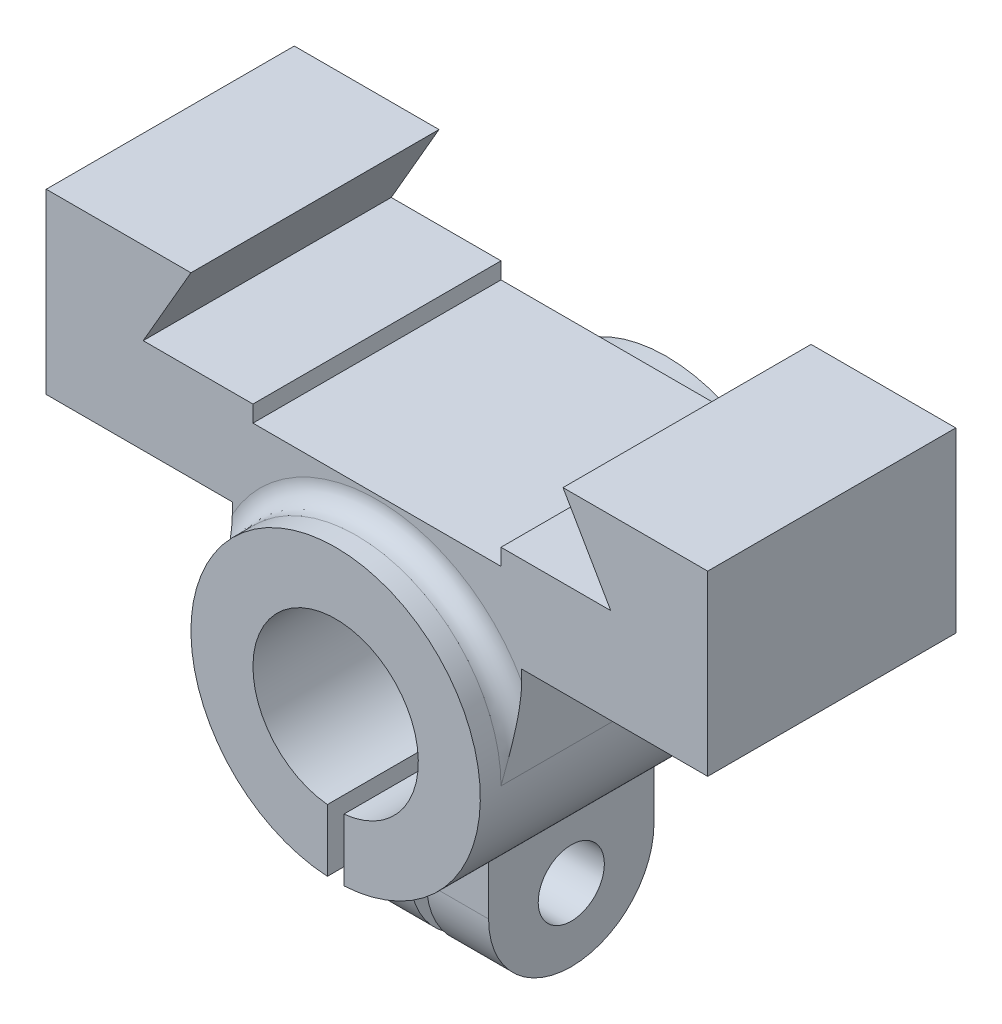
ISO-10303-21;
HEADER;
FILE_DESCRIPTION(('STEP AP214'),'2;1');
FILE_NAME('part.step','',(''),(''),'','','');
FILE_SCHEMA(('AUTOMOTIVE_DESIGN { 1 0 10303 214 1 1 1 1 }'));
ENDSEC;
DATA;
#1=APPLICATION_CONTEXT('core data for automotive mechanical design processes');
#2=APPLICATION_PROTOCOL_DEFINITION('international standard','automotive_design',2000,#1);
#3=PRODUCT_CONTEXT('',#1,'mechanical');
#4=PRODUCT('Part','Part','',(#3));
#5=PRODUCT_RELATED_PRODUCT_CATEGORY('part','',(#4));
#6=PRODUCT_DEFINITION_FORMATION('','',#4);
#7=PRODUCT_DEFINITION_CONTEXT('part definition',#1,'design');
#8=PRODUCT_DEFINITION('design','',#6,#7);
#9=PRODUCT_DEFINITION_SHAPE('','',#8);
#10=(LENGTH_UNIT() NAMED_UNIT(*) SI_UNIT(.MILLI.,.METRE.));
#11=(NAMED_UNIT(*) PLANE_ANGLE_UNIT() SI_UNIT($,.RADIAN.));
#12=(NAMED_UNIT(*) SI_UNIT($,.STERADIAN.) SOLID_ANGLE_UNIT());
#13=UNCERTAINTY_MEASURE_WITH_UNIT(LENGTH_MEASURE(1.E-05),#10,'distance_accuracy_value','');
#14=(GEOMETRIC_REPRESENTATION_CONTEXT(3) GLOBAL_UNCERTAINTY_ASSIGNED_CONTEXT((#13)) GLOBAL_UNIT_ASSIGNED_CONTEXT((#10,
#11,#12)) REPRESENTATION_CONTEXT('',''));
#15=CARTESIAN_POINT('',(0.,0.,0.));
#16=DIRECTION('',(0.,0.,1.));
#17=DIRECTION('',(1.,0.,0.));
#18=AXIS2_PLACEMENT_3D('',#15,#16,#17);
#19=CARTESIAN_POINT('',(-119.306058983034,-1.16931228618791,-40.));
#20=DIRECTION('',(0.,0.,1.));
#21=DIRECTION('',(1.,0.,0.));
#22=AXIS2_PLACEMENT_3D('',#19,#20,#21);
#23=CYLINDRICAL_SURFACE('',#22,35.);
#24=DIRECTION('',(0.,0.,1.));
#25=VECTOR('',#24,1.);
#26=CARTESIAN_POINT('',(-121.306058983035,-36.1121227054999,-40.));
#27=LINE('',#26,#25);
#28=CARTESIAN_POINT('',(-121.306058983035,-36.1121227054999,20.));
#29=VERTEX_POINT('',#28);
#30=CARTESIAN_POINT('',(-121.306058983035,-36.1121227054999,40.));
#31=VERTEX_POINT('',#30);
#32=EDGE_CURVE('E348',#29,#31,#27,.T.);
#33=ORIENTED_EDGE('',*,*,#32,.T.);
#34=CARTESIAN_POINT('',(-119.306058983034,-1.16931228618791,40.));
#35=DIRECTION('',(0.,0.,1.));
#36=DIRECTION('',(1.,0.,0.));
#37=AXIS2_PLACEMENT_3D('',#34,#35,#36);
#38=CIRCLE('',#37,35.);
#39=CARTESIAN_POINT('',(-117.306058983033,-36.1121227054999,40.));
#40=VERTEX_POINT('',#39);
#41=EDGE_CURVE('E468',#31,#40,#38,.F.);
#42=ORIENTED_EDGE('',*,*,#41,.T.);
#43=DIRECTION('',(0.,0.,1.));
#44=VECTOR('',#43,1.);
#45=CARTESIAN_POINT('',(-117.306058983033,-36.1121227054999,-40.));
#46=LINE('',#45,#44);
#47=CARTESIAN_POINT('',(-117.306058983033,-36.1121227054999,20.));
#48=VERTEX_POINT('',#47);
#49=EDGE_CURVE('E503',#48,#40,#46,.T.);
#50=ORIENTED_EDGE('',*,*,#49,.F.);
#51=CARTESIAN_POINT('',(-119.306058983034,-1.16931228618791,20.));
#52=DIRECTION('',(0.,0.,1.));
#53=DIRECTION('',(1.,0.,0.));
#54=AXIS2_PLACEMENT_3D('',#51,#52,#53);
#55=CIRCLE('',#54,35.);
#56=CARTESIAN_POINT('',(-102.306058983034,-31.7634293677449,20.));
#57=VERTEX_POINT('',#56);
#58=EDGE_CURVE('E696',#57,#48,#55,.F.);
#59=ORIENTED_EDGE('',*,*,#58,.F.);
#60=DIRECTION('',(0.,0.,1.));
#61=VECTOR('',#60,1.);
#62=CARTESIAN_POINT('',(-102.306058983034,-31.7634293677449,-20.));
#63=LINE('',#62,#61);
#64=CARTESIAN_POINT('',(-102.306058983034,-31.7634293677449,-20.));
#65=VERTEX_POINT('',#64);
#66=EDGE_CURVE('E543',#65,#57,#63,.T.);
#67=ORIENTED_EDGE('',*,*,#66,.F.);
#68=CARTESIAN_POINT('',(-119.306058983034,-1.16931228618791,-20.));
#69=DIRECTION('',(0.,0.,1.));
#70=DIRECTION('',(1.,0.,0.));
#71=AXIS2_PLACEMENT_3D('',#68,#69,#70);
#72=CIRCLE('',#71,35.);
#73=CARTESIAN_POINT('',(-117.306058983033,-36.1121227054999,-20.));
#74=VERTEX_POINT('',#73);
#75=EDGE_CURVE('E703',#65,#74,#72,.F.);
#76=ORIENTED_EDGE('',*,*,#75,.T.);
#77=CARTESIAN_POINT('',(-117.306058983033,-36.1121227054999,-40.));
#78=VERTEX_POINT('',#77);
#79=EDGE_CURVE('E499',#78,#74,#46,.T.);
#80=ORIENTED_EDGE('',*,*,#79,.F.);
#81=CARTESIAN_POINT('',(-119.306058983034,-1.16931228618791,-40.));
#82=DIRECTION('',(0.,0.,1.));
#83=DIRECTION('',(1.,0.,0.));
#84=AXIS2_PLACEMENT_3D('',#81,#82,#83);
#85=CIRCLE('',#84,35.);
#86=CARTESIAN_POINT('',(-121.306058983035,-36.1121227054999,-40.));
#87=VERTEX_POINT('',#86);
#88=EDGE_CURVE('E497',#87,#78,#85,.F.);
#89=ORIENTED_EDGE('',*,*,#88,.F.);
#90=CARTESIAN_POINT('',(-121.306058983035,-36.1121227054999,-20.));
#91=VERTEX_POINT('',#90);
#92=EDGE_CURVE('E345',#87,#91,#27,.T.);
#93=ORIENTED_EDGE('',*,*,#92,.T.);
#94=CARTESIAN_POINT('',(-119.306058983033,-1.16931228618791,-20.));
#95=DIRECTION('',(0.,0.,-1.));
#96=DIRECTION('',(-1.,0.,0.));
#97=AXIS2_PLACEMENT_3D('',#94,#95,#96);
#98=CIRCLE('',#97,35.);
#99=CARTESIAN_POINT('',(-136.306058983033,-31.7634293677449,-20.));
#100=VERTEX_POINT('',#99);
#101=EDGE_CURVE('E278',#100,#91,#98,.F.);
#102=ORIENTED_EDGE('',*,*,#101,.F.);
#103=DIRECTION('',(0.,0.,1.));
#104=VECTOR('',#103,1.);
#105=CARTESIAN_POINT('',(-136.306058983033,-31.7634293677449,-20.));
#106=LINE('',#105,#104);
#107=CARTESIAN_POINT('',(-136.306058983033,-31.7634293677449,20.));
#108=VERTEX_POINT('',#107);
#109=EDGE_CURVE('E258',#100,#108,#106,.T.);
#110=ORIENTED_EDGE('',*,*,#109,.T.);
#111=CARTESIAN_POINT('',(-119.306058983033,-1.16931228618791,20.));
#112=DIRECTION('',(0.,0.,-1.));
#113=DIRECTION('',(-1.,0.,0.));
#114=AXIS2_PLACEMENT_3D('',#111,#112,#113);
#115=CIRCLE('',#114,35.);
#116=EDGE_CURVE('E264',#108,#29,#115,.F.);
#117=ORIENTED_EDGE('',*,*,#116,.T.);
#118=EDGE_LOOP('',(#33,#42,#50,#59,#67,#76,#80,#89,#93,#102,#110,#117));
#119=FACE_BOUND('',#118,.T.);
#120=CARTESIAN_POINT('',(-119.306058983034,-1.16931228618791,35.));
#121=DIRECTION('',(0.,0.,1.));
#122=DIRECTION('',(1.,0.,0.));
#123=AXIS2_PLACEMENT_3D('',#120,#121,#122);
#124=CIRCLE('',#123,35.);
#125=CARTESIAN_POINT('',(-84.3060589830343,-1.16931228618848,35.));
#126=VERTEX_POINT('',#125);
#127=CARTESIAN_POINT('',(-154.306058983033,-1.16931228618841,35.));
#128=VERTEX_POINT('',#127);
#129=EDGE_CURVE('E517',#126,#128,#124,.T.);
#130=ORIENTED_EDGE('',*,*,#129,.T.);
#131=DIRECTION('',(0.,0.,1.));
#132=VECTOR('',#131,1.);
#133=CARTESIAN_POINT('',(-154.306058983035,-1.16931228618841,-30.));
#134=LINE('',#133,#132);
#135=CARTESIAN_POINT('',(-154.306058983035,-1.16931228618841,-35.));
#136=VERTEX_POINT('',#135);
#137=EDGE_CURVE('E314',#136,#128,#134,.T.);
#138=ORIENTED_EDGE('',*,*,#137,.F.);
#139=CARTESIAN_POINT('',(-119.306058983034,-1.16931228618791,-35.));
#140=DIRECTION('',(0.,0.,1.));
#141=DIRECTION('',(1.,0.,0.));
#142=AXIS2_PLACEMENT_3D('',#139,#140,#141);
#143=CIRCLE('',#142,35.);
#144=CARTESIAN_POINT('',(-84.3060589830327,-1.16931228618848,-35.));
#145=VERTEX_POINT('',#144);
#146=EDGE_CURVE('E524',#136,#145,#143,.F.);
#147=ORIENTED_EDGE('',*,*,#146,.T.);
#148=DIRECTION('',(0.,0.,1.));
#149=VECTOR('',#148,1.);
#150=CARTESIAN_POINT('',(-84.3060589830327,-1.16931228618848,-30.));
#151=LINE('',#150,#149);
#152=EDGE_CURVE('E491',#145,#126,#151,.T.);
#153=ORIENTED_EDGE('',*,*,#152,.T.);
#154=EDGE_LOOP('',(#130,#138,#147,#153));
#155=FACE_BOUND('',#154,.T.);
#156=ADVANCED_FACE('F39',(#119,#155),#23,.T.);
#157=CARTESIAN_POINT('',(-117.306058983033,0.,-40.));
#158=DIRECTION('',(1.,0.,0.));
#159=DIRECTION('',(0.,0.,-1.));
#160=AXIS2_PLACEMENT_3D('',#157,#158,#159);
#161=PLANE('',#160);
#162=CARTESIAN_POINT('',(-117.306058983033,-48.0000000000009,0.));
#163=DIRECTION('',(1.,0.,0.));
#164=DIRECTION('',(0.,0.,-1.));
#165=AXIS2_PLACEMENT_3D('',#162,#163,#164);
#166=CIRCLE('',#165,8.);
#167=CARTESIAN_POINT('',(-117.306058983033,-48.0000000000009,-8.00000000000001));
#168=VERTEX_POINT('',#167);
#169=EDGE_CURVE('E522',#168,#168,#166,.T.);
#170=ORIENTED_EDGE('',*,*,#169,.T.);
#171=EDGE_LOOP('',(#170));
#172=FACE_BOUND('',#171,.T.);
#173=CARTESIAN_POINT('',(-117.306058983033,-45.5465356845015,0.));
#174=DIRECTION('',(1.,0.,0.));
#175=DIRECTION('',(0.,0.,-1.));
#176=AXIS2_PLACEMENT_3D('',#173,#174,#175);
#177=CIRCLE('',#176,20.);
#178=CARTESIAN_POINT('',(-117.306058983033,-45.5465356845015,-20.));
#179=VERTEX_POINT('',#178);
#180=CARTESIAN_POINT('',(-117.306058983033,-65.5465356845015,0.));
#181=VERTEX_POINT('',#180);
#182=EDGE_CURVE('E511',#179,#181,#177,.F.);
#183=ORIENTED_EDGE('',*,*,#182,.T.);
#184=CARTESIAN_POINT('',(-117.306058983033,-45.5465356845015,0.));
#185=DIRECTION('',(1.,0.,0.));
#186=DIRECTION('',(0.,0.,-1.));
#187=AXIS2_PLACEMENT_3D('',#184,#185,#186);
#188=CIRCLE('',#187,20.);
#189=CARTESIAN_POINT('',(-117.306058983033,-45.5465356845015,20.));
#190=VERTEX_POINT('',#189);
#191=EDGE_CURVE('E513',#181,#190,#188,.F.);
#192=ORIENTED_EDGE('',*,*,#191,.T.);
#193=DIRECTION('',(0.,1.,0.));
#194=VECTOR('',#193,1.);
#195=CARTESIAN_POINT('',(-117.306058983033,0.,20.));
#196=LINE('',#195,#194);
#197=EDGE_CURVE('E699',#190,#48,#196,.T.);
#198=ORIENTED_EDGE('',*,*,#197,.T.);
#199=ORIENTED_EDGE('',*,*,#49,.T.);
#200=DIRECTION('',(0.,1.,0.));
#201=VECTOR('',#200,1.);
#202=CARTESIAN_POINT('',(-117.306058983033,0.,40.));
#203=LINE('',#202,#201);
#204=CARTESIAN_POINT('',(-117.306058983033,-21.0690610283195,40.));
#205=VERTEX_POINT('',#204);
#206=EDGE_CURVE('E472',#40,#205,#203,.T.);
#207=ORIENTED_EDGE('',*,*,#206,.T.);
#208=DIRECTION('',(0.,0.,1.));
#209=VECTOR('',#208,1.);
#210=CARTESIAN_POINT('',(-117.306058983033,-21.0690610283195,-40.));
#211=LINE('',#210,#209);
#212=CARTESIAN_POINT('',(-117.306058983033,-21.0690610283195,-40.));
#213=VERTEX_POINT('',#212);
#214=EDGE_CURVE('E484',#213,#205,#211,.T.);
#215=ORIENTED_EDGE('',*,*,#214,.F.);
#216=DIRECTION('',(0.,1.,0.));
#217=VECTOR('',#216,1.);
#218=CARTESIAN_POINT('',(-117.306058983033,0.,-40.));
#219=LINE('',#218,#217);
#220=EDGE_CURVE('E495',#78,#213,#219,.T.);
#221=ORIENTED_EDGE('',*,*,#220,.F.);
#222=ORIENTED_EDGE('',*,*,#79,.T.);
#223=DIRECTION('',(0.,1.,0.));
#224=VECTOR('',#223,1.);
#225=CARTESIAN_POINT('',(-117.306058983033,0.,-20.));
#226=LINE('',#225,#224);
#227=EDGE_CURVE('E548',#179,#74,#226,.T.);
#228=ORIENTED_EDGE('',*,*,#227,.F.);
#229=EDGE_LOOP('',(#183,#192,#198,#199,#207,#215,#221,#222,#228));
#230=FACE_BOUND('',#229,.T.);
#231=ADVANCED_FACE('F411',(#172,#230),#161,.F.);
#232=CARTESIAN_POINT('',(-119.306058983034,-1.16931228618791,-40.));
#233=DIRECTION('',(0.,0.,1.));
#234=DIRECTION('',(1.,0.,0.));
#235=AXIS2_PLACEMENT_3D('',#232,#233,#234);
#236=CYLINDRICAL_SURFACE('',#235,20.);
#237=ORIENTED_EDGE('',*,*,#214,.T.);
#238=CARTESIAN_POINT('',(-119.306058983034,-1.16931228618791,40.));
#239=DIRECTION('',(0.,0.,1.));
#240=DIRECTION('',(1.,0.,0.));
#241=AXIS2_PLACEMENT_3D('',#238,#239,#240);
#242=CIRCLE('',#241,20.);
#243=CARTESIAN_POINT('',(-121.306058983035,-21.0690610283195,40.));
#244=VERTEX_POINT('',#243);
#245=EDGE_CURVE('E482',#244,#205,#242,.F.);
#246=ORIENTED_EDGE('',*,*,#245,.F.);
#247=DIRECTION('',(0.,0.,1.));
#248=VECTOR('',#247,1.);
#249=CARTESIAN_POINT('',(-121.306058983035,-21.0690610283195,-40.));
#250=LINE('',#249,#248);
#251=CARTESIAN_POINT('',(-121.306058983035,-21.0690610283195,-40.));
#252=VERTEX_POINT('',#251);
#253=EDGE_CURVE('E344',#252,#244,#250,.T.);
#254=ORIENTED_EDGE('',*,*,#253,.F.);
#255=CARTESIAN_POINT('',(-119.306058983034,-1.16931228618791,-40.));
#256=DIRECTION('',(0.,0.,1.));
#257=DIRECTION('',(1.,0.,0.));
#258=AXIS2_PLACEMENT_3D('',#255,#256,#257);
#259=CIRCLE('',#258,20.);
#260=EDGE_CURVE('E474',#252,#213,#259,.F.);
#261=ORIENTED_EDGE('',*,*,#260,.T.);
#262=EDGE_LOOP('',(#237,#246,#254,#261));
#263=FACE_BOUND('',#262,.T.);
#264=ADVANCED_FACE('F416',(#263),#236,.F.);
#265=CARTESIAN_POINT('',(0.,0.,-40.));
#266=DIRECTION('',(0.,0.,1.));
#267=DIRECTION('',(1.,0.,0.));
#268=AXIS2_PLACEMENT_3D('',#265,#266,#267);
#269=PLANE('',#268);
#270=ORIENTED_EDGE('',*,*,#260,.F.);
#271=DIRECTION('',(0.,1.,0.));
#272=VECTOR('',#271,1.);
#273=CARTESIAN_POINT('',(-121.306058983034,0.,-40.));
#274=LINE('',#273,#272);
#275=EDGE_CURVE('E341',#87,#252,#274,.T.);
#276=ORIENTED_EDGE('',*,*,#275,.F.);
#277=ORIENTED_EDGE('',*,*,#88,.T.);
#278=ORIENTED_EDGE('',*,*,#220,.T.);
#279=EDGE_LOOP('',(#270,#276,#277,#278));
#280=FACE_BOUND('',#279,.T.);
#281=ADVANCED_FACE('F420',(#280),#269,.F.);
#282=CARTESIAN_POINT('',(0.,0.,40.));
#283=DIRECTION('',(0.,0.,1.));
#284=DIRECTION('',(1.,0.,0.));
#285=AXIS2_PLACEMENT_3D('',#282,#283,#284);
#286=PLANE('',#285);
#287=ORIENTED_EDGE('',*,*,#41,.F.);
#288=DIRECTION('',(0.,1.,0.));
#289=VECTOR('',#288,1.);
#290=CARTESIAN_POINT('',(-121.306058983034,0.,40.));
#291=LINE('',#290,#289);
#292=EDGE_CURVE('E318',#31,#244,#291,.T.);
#293=ORIENTED_EDGE('',*,*,#292,.T.);
#294=ORIENTED_EDGE('',*,*,#245,.T.);
#295=ORIENTED_EDGE('',*,*,#206,.F.);
#296=EDGE_LOOP('',(#287,#293,#294,#295));
#297=FACE_BOUND('',#296,.T.);
#298=ADVANCED_FACE('F453',(#297),#286,.T.);
#299=CARTESIAN_POINT('',(-6.17250712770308E-13,39.8306877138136,-30.));
#300=DIRECTION('',(0.,1.,0.));
#301=DIRECTION('',(-1.,0.,0.));
#302=AXIS2_PLACEMENT_3D('',#299,#300,#301);
#303=PLANE('',#302);
#304=DIRECTION('',(-1.,0.,0.));
#305=VECTOR('',#304,1.);
#306=CARTESIAN_POINT('',(-6.17250712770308E-13,39.8306877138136,-30.));
#307=LINE('',#306,#305);
#308=CARTESIAN_POINT('',(-89.306058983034,39.8306877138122,-30.));
#309=VERTEX_POINT('',#308);
#310=CARTESIAN_POINT('',(-149.306058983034,39.8306877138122,-30.));
#311=VERTEX_POINT('',#310);
#312=EDGE_CURVE('E588',#309,#311,#307,.T.);
#313=ORIENTED_EDGE('',*,*,#312,.T.);
#314=DIRECTION('',(0.,0.,1.));
#315=VECTOR('',#314,1.);
#316=CARTESIAN_POINT('',(-149.306058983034,39.8306877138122,-30.));
#317=LINE('',#316,#315);
#318=CARTESIAN_POINT('',(-149.306058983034,39.8306877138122,30.));
#319=VERTEX_POINT('',#318);
#320=EDGE_CURVE('E315',#311,#319,#317,.T.);
#321=ORIENTED_EDGE('',*,*,#320,.T.);
#322=DIRECTION('',(-1.,0.,0.));
#323=VECTOR('',#322,1.);
#324=CARTESIAN_POINT('',(-6.17250712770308E-13,39.8306877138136,30.));
#325=LINE('',#324,#323);
#326=CARTESIAN_POINT('',(-89.306058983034,39.8306877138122,30.));
#327=VERTEX_POINT('',#326);
#328=EDGE_CURVE('E566',#327,#319,#325,.T.);
#329=ORIENTED_EDGE('',*,*,#328,.F.);
#330=DIRECTION('',(0.,0.,1.));
#331=VECTOR('',#330,1.);
#332=CARTESIAN_POINT('',(-89.306058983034,39.8306877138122,-30.));
#333=LINE('',#332,#331);
#334=EDGE_CURVE('E485',#309,#327,#333,.T.);
#335=ORIENTED_EDGE('',*,*,#334,.F.);
#336=EDGE_LOOP('',(#313,#321,#329,#335));
#337=FACE_BOUND('',#336,.T.);
#338=ADVANCED_FACE('F456',(#337),#303,.T.);
#339=CARTESIAN_POINT('',(-89.3060589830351,2.47874107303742E-12,-30.));
#340=DIRECTION('',(-1.,0.,0.));
#341=DIRECTION('',(0.,-1.,0.));
#342=AXIS2_PLACEMENT_3D('',#339,#340,#341);
#343=PLANE('',#342);
#344=ORIENTED_EDGE('',*,*,#334,.T.);
#345=DIRECTION('',(0.,-1.,0.));
#346=VECTOR('',#345,1.);
#347=CARTESIAN_POINT('',(-89.3060589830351,2.47874107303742E-12,30.));
#348=LINE('',#347,#346);
#349=CARTESIAN_POINT('',(-89.3060589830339,43.8306877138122,30.));
#350=VERTEX_POINT('',#349);
#351=EDGE_CURVE('E563',#350,#327,#348,.T.);
#352=ORIENTED_EDGE('',*,*,#351,.F.);
#353=DIRECTION('',(0.,0.,1.));
#354=VECTOR('',#353,1.);
#355=CARTESIAN_POINT('',(-89.3060589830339,43.8306877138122,-30.));
#356=LINE('',#355,#354);
#357=CARTESIAN_POINT('',(-89.3060589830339,43.8306877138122,-30.));
#358=VERTEX_POINT('',#357);
#359=EDGE_CURVE('E488',#358,#350,#356,.T.);
#360=ORIENTED_EDGE('',*,*,#359,.F.);
#361=DIRECTION('',(0.,-1.,0.));
#362=VECTOR('',#361,1.);
#363=CARTESIAN_POINT('',(-89.3060589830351,2.47874107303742E-12,-30.));
#364=LINE('',#363,#362);
#365=EDGE_CURVE('E585',#358,#309,#364,.T.);
#366=ORIENTED_EDGE('',*,*,#365,.T.);
#367=EDGE_LOOP('',(#344,#352,#360,#366));
#368=FACE_BOUND('',#367,.T.);
#369=ADVANCED_FACE('F462',(#368),#343,.T.);
#370=CARTESIAN_POINT('',(1.28313105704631E-12,43.8306877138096,-30.));
#371=DIRECTION('',(0.,1.,0.));
#372=DIRECTION('',(-1.,0.,0.));
#373=AXIS2_PLACEMENT_3D('',#370,#371,#372);
#374=PLANE('',#373);
#375=ORIENTED_EDGE('',*,*,#359,.T.);
#376=DIRECTION('',(-1.,0.,0.));
#377=VECTOR('',#376,1.);
#378=CARTESIAN_POINT('',(1.28313105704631E-12,43.8306877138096,30.));
#379=LINE('',#378,#377);
#380=CARTESIAN_POINT('',(-62.7590535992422,43.8306877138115,30.));
#381=VERTEX_POINT('',#380);
#382=EDGE_CURVE('E560',#381,#350,#379,.T.);
#383=ORIENTED_EDGE('',*,*,#382,.F.);
#384=DIRECTION('',(0.,0.,1.));
#385=VECTOR('',#384,1.);
#386=CARTESIAN_POINT('',(-62.7590535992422,43.8306877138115,-30.));
#387=LINE('',#386,#385);
#388=CARTESIAN_POINT('',(-62.7590535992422,43.8306877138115,-30.));
#389=VERTEX_POINT('',#388);
#390=EDGE_CURVE('E591',#389,#381,#387,.T.);
#391=ORIENTED_EDGE('',*,*,#390,.F.);
#392=DIRECTION('',(-1.,0.,0.));
#393=VECTOR('',#392,1.);
#394=CARTESIAN_POINT('',(1.28313105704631E-12,43.8306877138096,-30.));
#395=LINE('',#394,#393);
#396=EDGE_CURVE('E582',#389,#358,#395,.T.);
#397=ORIENTED_EDGE('',*,*,#396,.T.);
#398=EDGE_LOOP('',(#375,#383,#391,#397));
#399=FACE_BOUND('',#398,.T.);
#400=ADVANCED_FACE('F637',(#399),#374,.T.);
#401=CARTESIAN_POINT('',(-28.0900456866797,-16.2177954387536,-30.));
#402=DIRECTION('',(-0.866025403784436,-0.500000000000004,0.));
#403=DIRECTION('',(0.500000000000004,-0.866025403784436,0.));
#404=AXIS2_PLACEMENT_3D('',#401,#402,#403);
#405=PLANE('',#404);
#406=ORIENTED_EDGE('',*,*,#390,.T.);
#407=DIRECTION('',(0.500000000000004,-0.866025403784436,0.));
#408=VECTOR('',#407,1.);
#409=CARTESIAN_POINT('',(-28.0900456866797,-16.2177954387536,30.));
#410=LINE('',#409,#408);
#411=CARTESIAN_POINT('',(-74.3060589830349,63.8306877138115,30.));
#412=VERTEX_POINT('',#411);
#413=EDGE_CURVE('E557',#412,#381,#410,.T.);
#414=ORIENTED_EDGE('',*,*,#413,.F.);
#415=DIRECTION('',(0.,0.,1.));
#416=VECTOR('',#415,1.);
#417=CARTESIAN_POINT('',(-74.3060589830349,63.8306877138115,-30.));
#418=LINE('',#417,#416);
#419=CARTESIAN_POINT('',(-74.3060589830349,63.8306877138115,-30.));
#420=VERTEX_POINT('',#419);
#421=EDGE_CURVE('E593',#420,#412,#418,.T.);
#422=ORIENTED_EDGE('',*,*,#421,.F.);
#423=DIRECTION('',(0.500000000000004,-0.866025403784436,0.));
#424=VECTOR('',#423,1.);
#425=CARTESIAN_POINT('',(-28.0900456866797,-16.2177954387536,-30.));
#426=LINE('',#425,#424);
#427=EDGE_CURVE('E579',#420,#389,#426,.T.);
#428=ORIENTED_EDGE('',*,*,#427,.T.);
#429=EDGE_LOOP('',(#406,#414,#422,#428));
#430=FACE_BOUND('',#429,.T.);
#431=ADVANCED_FACE('F641',(#430),#405,.T.);
#432=CARTESIAN_POINT('',(-1.13892266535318E-12,63.8306877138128,-30.));
#433=DIRECTION('',(0.,1.,0.));
#434=DIRECTION('',(-1.,0.,0.));
#435=AXIS2_PLACEMENT_3D('',#432,#433,#434);
#436=PLANE('',#435);
#437=ORIENTED_EDGE('',*,*,#421,.T.);
#438=DIRECTION('',(-1.,0.,0.));
#439=VECTOR('',#438,1.);
#440=CARTESIAN_POINT('',(-1.13892266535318E-12,63.8306877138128,30.));
#441=LINE('',#440,#439);
#442=CARTESIAN_POINT('',(-39.3060589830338,63.8306877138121,30.));
#443=VERTEX_POINT('',#442);
#444=EDGE_CURVE('E554',#443,#412,#441,.T.);
#445=ORIENTED_EDGE('',*,*,#444,.F.);
#446=DIRECTION('',(0.,0.,1.));
#447=VECTOR('',#446,1.);
#448=CARTESIAN_POINT('',(-39.3060589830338,63.8306877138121,-30.));
#449=LINE('',#448,#447);
#450=CARTESIAN_POINT('',(-39.3060589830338,63.8306877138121,-30.));
#451=VERTEX_POINT('',#450);
#452=EDGE_CURVE('E595',#451,#443,#449,.T.);
#453=ORIENTED_EDGE('',*,*,#452,.F.);
#454=DIRECTION('',(-1.,0.,0.));
#455=VECTOR('',#454,1.);
#456=CARTESIAN_POINT('',(-1.13892266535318E-12,63.8306877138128,-30.));
#457=LINE('',#456,#455);
#458=EDGE_CURVE('E576',#451,#420,#457,.T.);
#459=ORIENTED_EDGE('',*,*,#458,.T.);
#460=EDGE_LOOP('',(#437,#445,#453,#459));
#461=FACE_BOUND('',#460,.T.);
#462=ADVANCED_FACE('F646',(#461),#436,.T.);
#463=CARTESIAN_POINT('',(-39.3060589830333,-3.5519702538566E-13,-30.));
#464=DIRECTION('',(1.,0.,0.));
#465=DIRECTION('',(0.,1.,0.));
#466=AXIS2_PLACEMENT_3D('',#463,#464,#465);
#467=PLANE('',#466);
#468=ORIENTED_EDGE('',*,*,#452,.T.);
#469=DIRECTION('',(0.,1.,0.));
#470=VECTOR('',#469,1.);
#471=CARTESIAN_POINT('',(-39.3060589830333,-3.5519702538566E-13,30.));
#472=LINE('',#471,#470);
#473=CARTESIAN_POINT('',(-39.3060589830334,20.8306877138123,30.));
#474=VERTEX_POINT('',#473);
#475=EDGE_CURVE('E545',#474,#443,#472,.T.);
#476=ORIENTED_EDGE('',*,*,#475,.F.);
#477=DIRECTION('',(0.,0.,1.));
#478=VECTOR('',#477,1.);
#479=CARTESIAN_POINT('',(-39.3060589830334,20.8306877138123,-30.));
#480=LINE('',#479,#478);
#481=CARTESIAN_POINT('',(-39.3060589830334,20.8306877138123,-30.));
#482=VERTEX_POINT('',#481);
#483=EDGE_CURVE('E597',#482,#474,#480,.T.);
#484=ORIENTED_EDGE('',*,*,#483,.F.);
#485=DIRECTION('',(0.,1.,0.));
#486=VECTOR('',#485,1.);
#487=CARTESIAN_POINT('',(-39.3060589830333,-3.5519702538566E-13,-30.));
#488=LINE('',#487,#486);
#489=EDGE_CURVE('E573',#482,#451,#488,.T.);
#490=ORIENTED_EDGE('',*,*,#489,.T.);
#491=EDGE_LOOP('',(#468,#476,#484,#490));
#492=FACE_BOUND('',#491,.T.);
#493=ADVANCED_FACE('F649',(#492),#467,.T.);
#494=CARTESIAN_POINT('',(-3.53324722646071E-13,20.830687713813,-30.));
#495=DIRECTION('',(0.,-1.,0.));
#496=DIRECTION('',(1.,0.,0.));
#497=AXIS2_PLACEMENT_3D('',#494,#495,#496);
#498=PLANE('',#497);
#499=ORIENTED_EDGE('',*,*,#483,.T.);
#500=DIRECTION('',(1.,0.,0.));
#501=VECTOR('',#500,1.);
#502=CARTESIAN_POINT('',(-3.53324722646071E-13,20.830687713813,30.));
#503=LINE('',#502,#501);
#504=CARTESIAN_POINT('',(-84.3060589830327,20.8306877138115,30.));
#505=VERTEX_POINT('',#504);
#506=EDGE_CURVE('E542',#505,#474,#503,.T.);
#507=ORIENTED_EDGE('',*,*,#506,.F.);
#508=DIRECTION('',(0.,0.,1.));
#509=VECTOR('',#508,1.);
#510=CARTESIAN_POINT('',(-84.3060589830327,20.8306877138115,-30.));
#511=LINE('',#510,#509);
#512=CARTESIAN_POINT('',(-84.3060589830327,20.8306877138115,-30.));
#513=VERTEX_POINT('',#512);
#514=EDGE_CURVE('E540',#513,#505,#511,.T.);
#515=ORIENTED_EDGE('',*,*,#514,.F.);
#516=DIRECTION('',(1.,0.,0.));
#517=VECTOR('',#516,1.);
#518=CARTESIAN_POINT('',(-3.53324722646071E-13,20.830687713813,-30.));
#519=LINE('',#518,#517);
#520=EDGE_CURVE('E570',#513,#482,#519,.T.);
#521=ORIENTED_EDGE('',*,*,#520,.T.);
#522=EDGE_LOOP('',(#499,#507,#515,#521));
#523=FACE_BOUND('',#522,.T.);
#524=ADVANCED_FACE('F451',(#523),#498,.T.);
#525=CARTESIAN_POINT('',(-84.3060589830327,0.,-30.));
#526=DIRECTION('',(1.,0.,0.));
#527=DIRECTION('',(0.,0.,-1.));
#528=AXIS2_PLACEMENT_3D('',#525,#526,#527);
#529=PLANE('',#528);
#530=ORIENTED_EDGE('',*,*,#514,.T.);
#531=DIRECTION('',(0.,1.,0.));
#532=VECTOR('',#531,1.);
#533=CARTESIAN_POINT('',(-84.3060589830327,0.,30.));
#534=LINE('',#533,#532);
#535=CARTESIAN_POINT('',(-84.3060589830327,18.1956044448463,30.));
#536=VERTEX_POINT('',#535);
#537=EDGE_CURVE('E534',#536,#505,#534,.T.);
#538=ORIENTED_EDGE('',*,*,#537,.F.);
#539=CARTESIAN_POINT('',(-84.3060589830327,18.1956044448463,30.));
#540=CARTESIAN_POINT('',(-84.3060589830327,17.9992399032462,30.0000046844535));
#541=CARTESIAN_POINT('',(-84.3060589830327,17.8028909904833,30.0027106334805));
#542=CARTESIAN_POINT('',(-84.3060589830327,17.4103470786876,30.0131839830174));
#543=CARTESIAN_POINT('',(-84.3060589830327,17.2141520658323,30.0209508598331));
#544=CARTESIAN_POINT('',(-84.3060589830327,16.6261654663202,30.051319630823));
#545=CARTESIAN_POINT('',(-84.3060589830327,16.2347271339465,30.0809905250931));
#546=CARTESIAN_POINT('',(-84.3060589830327,15.4545337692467,30.1567395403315));
#547=CARTESIAN_POINT('',(-84.3060589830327,15.0657743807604,30.2027741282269));
#548=CARTESIAN_POINT('',(-84.3060589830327,14.2901907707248,30.3092842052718));
#549=CARTESIAN_POINT('',(-84.3060589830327,13.9033668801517,30.3697620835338));
#550=CARTESIAN_POINT('',(-84.3060589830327,13.1352681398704,30.5028428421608));
#551=CARTESIAN_POINT('',(-84.3060589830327,12.7539742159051,30.5753365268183));
#552=CARTESIAN_POINT('',(-84.3060589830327,11.9936336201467,30.7313302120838));
#553=CARTESIAN_POINT('',(-84.3060589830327,11.6145871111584,30.8148310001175));
#554=CARTESIAN_POINT('',(-84.3060589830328,10.480351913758,31.0799409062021));
#555=CARTESIAN_POINT('',(-84.3060589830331,9.7285477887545,31.2760709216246));
#556=CARTESIAN_POINT('',(-84.3060589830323,8.12284264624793,31.7290189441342));
#557=CARTESIAN_POINT('',(-84.3060589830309,7.27028783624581,31.9905225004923));
#558=CARTESIAN_POINT('',(-84.3060589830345,5.57436401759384,32.5409204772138));
#559=CARTESIAN_POINT('',(-84.3060589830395,4.73099325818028,32.8298095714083));
#560=CARTESIAN_POINT('',(-84.3060589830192,2.20724213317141,33.7238196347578));
#561=CARTESIAN_POINT('',(-84.3060589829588,0.536349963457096,34.355320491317));
#562=CARTESIAN_POINT('',(-84.3060589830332,-1.14597895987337,34.991180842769));
#563=CARTESIAN_POINT('',(-84.3060589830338,-1.15764562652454,34.9955904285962));
#564=CARTESIAN_POINT('',(-84.3060589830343,-1.16931228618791,35.));
#565=B_SPLINE_CURVE_WITH_KNOTS('',3,(#539,#540,#541,#542,#543,#544,#545,#546,#547,#548,#549,
#550,#551,#552,#553,#554,#555,#556,#557,#558,#559,#560,#561,#562,#563,#564),.UNSPECIFIED.,.F.,
.F.,(4,2,2,2,2,2,2,2,2,2,2,2,4),(0.,0.589049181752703,1.17803741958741,2.35527916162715,
3.52941218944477,4.70373956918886,5.86792780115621,7.03219936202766,9.36220452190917,
12.0368380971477,14.71095255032,20.0689866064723,20.1064031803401),.UNSPECIFIED.);
#566=EDGE_CURVE('E11',#536,#126,#565,.T.);
#567=ORIENTED_EDGE('',*,*,#566,.T.);
#568=ORIENTED_EDGE('',*,*,#152,.F.);
#569=CARTESIAN_POINT('',(-84.3060589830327,18.1956044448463,-30.));
#570=CARTESIAN_POINT('',(-84.3060589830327,17.9992399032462,-30.0000046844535));
#571=CARTESIAN_POINT('',(-84.3060589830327,17.8028909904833,-30.0027106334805));
#572=CARTESIAN_POINT('',(-84.3060589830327,17.4103470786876,-30.0131839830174));
#573=CARTESIAN_POINT('',(-84.3060589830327,17.2141520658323,-30.0209508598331));
#574=CARTESIAN_POINT('',(-84.3060589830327,16.6261654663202,-30.051319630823));
#575=CARTESIAN_POINT('',(-84.3060589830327,16.2347271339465,-30.0809905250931));
#576=CARTESIAN_POINT('',(-84.3060589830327,15.4545337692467,-30.1567395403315));
#577=CARTESIAN_POINT('',(-84.3060589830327,15.0657743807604,-30.2027741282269));
#578=CARTESIAN_POINT('',(-84.3060589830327,14.2901907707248,-30.3092842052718));
#579=CARTESIAN_POINT('',(-84.3060589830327,13.9033668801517,-30.3697620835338));
#580=CARTESIAN_POINT('',(-84.3060589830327,13.1352681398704,-30.5028428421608));
#581=CARTESIAN_POINT('',(-84.3060589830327,12.7539742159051,-30.5753365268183));
#582=CARTESIAN_POINT('',(-84.3060589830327,11.9936336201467,-30.7313302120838));
#583=CARTESIAN_POINT('',(-84.3060589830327,11.6145871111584,-30.8148310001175));
#584=CARTESIAN_POINT('',(-84.3060589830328,10.480351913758,-31.0799409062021));
#585=CARTESIAN_POINT('',(-84.3060589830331,9.7285477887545,-31.2760709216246));
#586=CARTESIAN_POINT('',(-84.3060589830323,8.12284264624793,-31.7290189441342));
#587=CARTESIAN_POINT('',(-84.3060589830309,7.27028783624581,-31.9905225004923));
#588=CARTESIAN_POINT('',(-84.3060589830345,5.57436401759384,-32.5409204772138));
#589=CARTESIAN_POINT('',(-84.3060589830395,4.73099325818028,-32.8298095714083));
#590=CARTESIAN_POINT('',(-84.3060589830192,2.20724213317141,-33.7238196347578));
#591=CARTESIAN_POINT('',(-84.3060589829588,0.536349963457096,-34.355320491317));
#592=CARTESIAN_POINT('',(-84.3060589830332,-1.14597895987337,-34.991180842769));
#593=CARTESIAN_POINT('',(-84.3060589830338,-1.15764562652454,-34.9955904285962));
#594=CARTESIAN_POINT('',(-84.3060589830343,-1.16931228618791,-35.));
#595=B_SPLINE_CURVE_WITH_KNOTS('',3,(#569,#570,#571,#572,#573,#574,#575,#576,#577,#578,#579,
#580,#581,#582,#583,#584,#585,#586,#587,#588,#589,#590,#591,#592,#593,#594),.UNSPECIFIED.,.F.,
.F.,(4,2,2,2,2,2,2,2,2,2,2,2,4),(0.,0.589049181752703,1.17803741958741,2.35527916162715,
3.52941218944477,4.70373956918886,5.86792780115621,7.03219936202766,9.36220452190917,
12.0368380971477,14.71095255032,20.0689866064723,20.1064031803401),.UNSPECIFIED.);
#596=CARTESIAN_POINT('',(-84.3060589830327,18.1956044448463,-30.));
#597=VERTEX_POINT('',#596);
#598=EDGE_CURVE('E53',#145,#597,#595,.F.);
#599=ORIENTED_EDGE('',*,*,#598,.T.);
#600=DIRECTION('',(0.,1.,0.));
#601=VECTOR('',#600,1.);
#602=CARTESIAN_POINT('',(-84.3060589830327,0.,-30.));
#603=LINE('',#602,#601);
#604=EDGE_CURVE('E568',#597,#513,#603,.T.);
#605=ORIENTED_EDGE('',*,*,#604,.T.);
#606=EDGE_LOOP('',(#530,#538,#567,#568,#599,#605));
#607=FACE_BOUND('',#606,.T.);
#608=ADVANCED_FACE('F446',(#607),#529,.T.);
#609=CARTESIAN_POINT('',(0.,0.,-30.));
#610=DIRECTION('',(0.,0.,1.));
#611=DIRECTION('',(1.,0.,0.));
#612=AXIS2_PLACEMENT_3D('',#609,#610,#611);
#613=PLANE('',#612);
#614=ORIENTED_EDGE('',*,*,#604,.F.);
#615=CARTESIAN_POINT('',(-119.306058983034,-1.16931228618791,-30.));
#616=DIRECTION('',(0.,0.,1.));
#617=DIRECTION('',(1.,0.,0.));
#618=AXIS2_PLACEMENT_3D('',#615,#616,#617);
#619=CIRCLE('',#618,40.);
#620=CARTESIAN_POINT('',(-154.306058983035,18.1956044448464,-30.));
#621=VERTEX_POINT('',#620);
#622=EDGE_CURVE('E526',#597,#621,#619,.T.);
#623=ORIENTED_EDGE('',*,*,#622,.T.);
#624=DIRECTION('',(0.,1.,0.));
#625=VECTOR('',#624,1.);
#626=CARTESIAN_POINT('',(-154.306058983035,0.,-30.));
#627=LINE('',#626,#625);
#628=CARTESIAN_POINT('',(-154.306058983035,20.8306877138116,-30.));
#629=VERTEX_POINT('',#628);
#630=EDGE_CURVE('E299',#621,#629,#627,.T.);
#631=ORIENTED_EDGE('',*,*,#630,.T.);
#632=DIRECTION('',(-1.,0.,0.));
#633=VECTOR('',#632,1.);
#634=CARTESIAN_POINT('',(-238.612117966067,20.8306877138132,-30.));
#635=LINE('',#634,#633);
#636=CARTESIAN_POINT('',(-199.306058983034,20.8306877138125,-30.));
#637=VERTEX_POINT('',#636);
#638=EDGE_CURVE('E301',#629,#637,#635,.T.);
#639=ORIENTED_EDGE('',*,*,#638,.T.);
#640=DIRECTION('',(0.,1.,0.));
#641=VECTOR('',#640,1.);
#642=CARTESIAN_POINT('',(-199.306058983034,-2.07167288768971E-13,-30.));
#643=LINE('',#642,#641);
#644=CARTESIAN_POINT('',(-199.306058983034,63.8306877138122,-30.));
#645=VERTEX_POINT('',#644);
#646=EDGE_CURVE('E303',#637,#645,#643,.T.);
#647=ORIENTED_EDGE('',*,*,#646,.T.);
#648=DIRECTION('',(1.,0.,0.));
#649=VECTOR('',#648,1.);
#650=CARTESIAN_POINT('',(-238.612117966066,63.830687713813,-30.));
#651=LINE('',#650,#649);
#652=CARTESIAN_POINT('',(-164.306058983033,63.8306877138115,-30.));
#653=VERTEX_POINT('',#652);
#654=EDGE_CURVE('E305',#645,#653,#651,.T.);
#655=ORIENTED_EDGE('',*,*,#654,.T.);
#656=DIRECTION('',(-0.500000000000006,-0.866025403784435,0.));
#657=VECTOR('',#656,1.);
#658=CARTESIAN_POINT('',(-210.522072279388,-16.2177954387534,-30.));
#659=LINE('',#658,#657);
#660=CARTESIAN_POINT('',(-175.853064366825,43.8306877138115,-30.));
#661=VERTEX_POINT('',#660);
#662=EDGE_CURVE('E307',#653,#661,#659,.T.);
#663=ORIENTED_EDGE('',*,*,#662,.T.);
#664=DIRECTION('',(1.,0.,0.));
#665=VECTOR('',#664,1.);
#666=CARTESIAN_POINT('',(-238.612117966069,43.8306877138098,-30.));
#667=LINE('',#666,#665);
#668=CARTESIAN_POINT('',(-149.306058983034,43.8306877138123,-30.));
#669=VERTEX_POINT('',#668);
#670=EDGE_CURVE('E309',#661,#669,#667,.T.);
#671=ORIENTED_EDGE('',*,*,#670,.T.);
#672=DIRECTION('',(0.,-1.,0.));
#673=VECTOR('',#672,1.);
#674=CARTESIAN_POINT('',(-149.306058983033,2.53425222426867E-12,-30.));
#675=LINE('',#674,#673);
#676=EDGE_CURVE('E311',#669,#311,#675,.T.);
#677=ORIENTED_EDGE('',*,*,#676,.T.);
#678=ORIENTED_EDGE('',*,*,#312,.F.);
#679=ORIENTED_EDGE('',*,*,#365,.F.);
#680=ORIENTED_EDGE('',*,*,#396,.F.);
#681=ORIENTED_EDGE('',*,*,#427,.F.);
#682=ORIENTED_EDGE('',*,*,#458,.F.);
#683=ORIENTED_EDGE('',*,*,#489,.F.);
#684=ORIENTED_EDGE('',*,*,#520,.F.);
#685=EDGE_LOOP('',(#614,#623,#631,#639,#647,#655,#663,#671,#677,#678,#679,#680,#681,#682,#683,#684));
#686=FACE_BOUND('',#685,.T.);
#687=ADVANCED_FACE('F450',(#686),#613,.F.);
#688=CARTESIAN_POINT('',(0.,0.,30.));
#689=DIRECTION('',(0.,0.,1.));
#690=DIRECTION('',(1.,0.,0.));
#691=AXIS2_PLACEMENT_3D('',#688,#689,#690);
#692=PLANE('',#691);
#693=ORIENTED_EDGE('',*,*,#328,.T.);
#694=DIRECTION('',(0.,-1.,0.));
#695=VECTOR('',#694,1.);
#696=CARTESIAN_POINT('',(-149.306058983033,2.53425222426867E-12,30.));
#697=LINE('',#696,#695);
#698=CARTESIAN_POINT('',(-149.306058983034,43.8306877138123,30.));
#699=VERTEX_POINT('',#698);
#700=EDGE_CURVE('E296',#699,#319,#697,.T.);
#701=ORIENTED_EDGE('',*,*,#700,.F.);
#702=DIRECTION('',(1.,0.,0.));
#703=VECTOR('',#702,1.);
#704=CARTESIAN_POINT('',(-238.612117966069,43.8306877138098,30.));
#705=LINE('',#704,#703);
#706=CARTESIAN_POINT('',(-175.853064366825,43.8306877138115,30.));
#707=VERTEX_POINT('',#706);
#708=EDGE_CURVE('E294',#707,#699,#705,.T.);
#709=ORIENTED_EDGE('',*,*,#708,.F.);
#710=DIRECTION('',(-0.500000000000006,-0.866025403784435,0.));
#711=VECTOR('',#710,1.);
#712=CARTESIAN_POINT('',(-210.522072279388,-16.2177954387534,30.));
#713=LINE('',#712,#711);
#714=CARTESIAN_POINT('',(-164.306058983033,63.8306877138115,30.));
#715=VERTEX_POINT('',#714);
#716=EDGE_CURVE('E292',#715,#707,#713,.T.);
#717=ORIENTED_EDGE('',*,*,#716,.F.);
#718=DIRECTION('',(1.,0.,0.));
#719=VECTOR('',#718,1.);
#720=CARTESIAN_POINT('',(-238.612117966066,63.830687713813,30.));
#721=LINE('',#720,#719);
#722=CARTESIAN_POINT('',(-199.306058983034,63.8306877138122,30.));
#723=VERTEX_POINT('',#722);
#724=EDGE_CURVE('E290',#723,#715,#721,.T.);
#725=ORIENTED_EDGE('',*,*,#724,.F.);
#726=DIRECTION('',(0.,1.,0.));
#727=VECTOR('',#726,1.);
#728=CARTESIAN_POINT('',(-199.306058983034,-2.07167288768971E-13,30.));
#729=LINE('',#728,#727);
#730=CARTESIAN_POINT('',(-199.306058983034,20.8306877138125,30.));
#731=VERTEX_POINT('',#730);
#732=EDGE_CURVE('E288',#731,#723,#729,.T.);
#733=ORIENTED_EDGE('',*,*,#732,.F.);
#734=DIRECTION('',(-1.,0.,0.));
#735=VECTOR('',#734,1.);
#736=CARTESIAN_POINT('',(-238.612117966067,20.8306877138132,30.));
#737=LINE('',#736,#735);
#738=CARTESIAN_POINT('',(-154.306058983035,20.8306877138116,30.));
#739=VERTEX_POINT('',#738);
#740=EDGE_CURVE('E282',#739,#731,#737,.T.);
#741=ORIENTED_EDGE('',*,*,#740,.F.);
#742=DIRECTION('',(0.,1.,0.));
#743=VECTOR('',#742,1.);
#744=CARTESIAN_POINT('',(-154.306058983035,0.,30.));
#745=LINE('',#744,#743);
#746=CARTESIAN_POINT('',(-154.306058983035,18.1956044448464,30.));
#747=VERTEX_POINT('',#746);
#748=EDGE_CURVE('E279',#747,#739,#745,.T.);
#749=ORIENTED_EDGE('',*,*,#748,.F.);
#750=CARTESIAN_POINT('',(-119.306058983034,-1.16931228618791,30.));
#751=DIRECTION('',(0.,0.,1.));
#752=DIRECTION('',(1.,0.,0.));
#753=AXIS2_PLACEMENT_3D('',#750,#751,#752);
#754=CIRCLE('',#753,40.);
#755=EDGE_CURVE('E444',#747,#536,#754,.F.);
#756=ORIENTED_EDGE('',*,*,#755,.T.);
#757=ORIENTED_EDGE('',*,*,#537,.T.);
#758=ORIENTED_EDGE('',*,*,#506,.T.);
#759=ORIENTED_EDGE('',*,*,#475,.T.);
#760=ORIENTED_EDGE('',*,*,#444,.T.);
#761=ORIENTED_EDGE('',*,*,#413,.T.);
#762=ORIENTED_EDGE('',*,*,#382,.T.);
#763=ORIENTED_EDGE('',*,*,#351,.T.);
#764=EDGE_LOOP('',(#693,#701,#709,#717,#725,#733,#741,#749,#756,#757,#758,#759,#760,#761,#762,#763));
#765=FACE_BOUND('',#764,.T.);
#766=ADVANCED_FACE('F532',(#765),#692,.T.);
#767=CARTESIAN_POINT('',(-102.306058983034,2.9418468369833E-13,-20.));
#768=DIRECTION('',(1.,0.,0.));
#769=DIRECTION('',(0.,1.,0.));
#770=AXIS2_PLACEMENT_3D('',#767,#768,#769);
#771=PLANE('',#770);
#772=CARTESIAN_POINT('',(-102.306058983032,-48.0000000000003,0.));
#773=DIRECTION('',(1.,0.,0.));
#774=DIRECTION('',(0.,1.,0.));
#775=AXIS2_PLACEMENT_3D('',#772,#773,#774);
#776=CIRCLE('',#775,8.);
#777=CARTESIAN_POINT('',(-102.306058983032,-40.0000000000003,0.));
#778=VERTEX_POINT('',#777);
#779=EDGE_CURVE('E690',#778,#778,#776,.T.);
#780=ORIENTED_EDGE('',*,*,#779,.F.);
#781=EDGE_LOOP('',(#780));
#782=FACE_BOUND('',#781,.T.);
#783=DIRECTION('',(0.,1.,0.));
#784=VECTOR('',#783,1.);
#785=CARTESIAN_POINT('',(-102.306058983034,2.9418468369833E-13,20.));
#786=LINE('',#785,#784);
#787=CARTESIAN_POINT('',(-102.306058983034,-45.5465356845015,20.));
#788=VERTEX_POINT('',#787);
#789=EDGE_CURVE('E521',#788,#57,#786,.T.);
#790=ORIENTED_EDGE('',*,*,#789,.F.);
#791=CARTESIAN_POINT('',(-102.306058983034,-45.5465356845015,0.));
#792=DIRECTION('',(1.,0.,0.));
#793=DIRECTION('',(0.,1.,0.));
#794=AXIS2_PLACEMENT_3D('',#791,#792,#793);
#795=CIRCLE('',#794,20.);
#796=CARTESIAN_POINT('',(-102.306058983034,-65.5465356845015,0.));
#797=VERTEX_POINT('',#796);
#798=EDGE_CURVE('E509',#788,#797,#795,.T.);
#799=ORIENTED_EDGE('',*,*,#798,.T.);
#800=CARTESIAN_POINT('',(-102.306058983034,-45.5465356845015,0.));
#801=DIRECTION('',(1.,0.,0.));
#802=DIRECTION('',(0.,1.,0.));
#803=AXIS2_PLACEMENT_3D('',#800,#801,#802);
#804=CIRCLE('',#803,20.);
#805=CARTESIAN_POINT('',(-102.306058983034,-45.5465356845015,-20.));
#806=VERTEX_POINT('',#805);
#807=EDGE_CURVE('E507',#797,#806,#804,.T.);
#808=ORIENTED_EDGE('',*,*,#807,.T.);
#809=DIRECTION('',(0.,1.,0.));
#810=VECTOR('',#809,1.);
#811=CARTESIAN_POINT('',(-102.306058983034,2.9418468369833E-13,-20.));
#812=LINE('',#811,#810);
#813=EDGE_CURVE('E701',#806,#65,#812,.T.);
#814=ORIENTED_EDGE('',*,*,#813,.T.);
#815=ORIENTED_EDGE('',*,*,#66,.T.);
#816=EDGE_LOOP('',(#790,#799,#808,#814,#815));
#817=FACE_BOUND('',#816,.T.);
#818=ADVANCED_FACE('F671',(#782,#817),#771,.T.);
#819=CARTESIAN_POINT('',(0.,0.,-20.));
#820=DIRECTION('',(0.,0.,1.));
#821=DIRECTION('',(1.,0.,0.));
#822=AXIS2_PLACEMENT_3D('',#819,#820,#821);
#823=PLANE('',#822);
#824=ORIENTED_EDGE('',*,*,#813,.F.);
#825=DIRECTION('',(1.,0.,0.));
#826=VECTOR('',#825,1.);
#827=CARTESIAN_POINT('',(-117.306058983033,-45.5465356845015,-20.));
#828=LINE('',#827,#826);
#829=EDGE_CURVE('E515',#806,#179,#828,.F.);
#830=ORIENTED_EDGE('',*,*,#829,.T.);
#831=ORIENTED_EDGE('',*,*,#227,.T.);
#832=ORIENTED_EDGE('',*,*,#75,.F.);
#833=EDGE_LOOP('',(#824,#830,#831,#832));
#834=FACE_BOUND('',#833,.T.);
#835=ADVANCED_FACE('F674',(#834),#823,.F.);
#836=CARTESIAN_POINT('',(0.,0.,20.));
#837=DIRECTION('',(0.,0.,1.));
#838=DIRECTION('',(1.,0.,0.));
#839=AXIS2_PLACEMENT_3D('',#836,#837,#838);
#840=PLANE('',#839);
#841=ORIENTED_EDGE('',*,*,#197,.F.);
#842=DIRECTION('',(1.,0.,0.));
#843=VECTOR('',#842,1.);
#844=CARTESIAN_POINT('',(0.,-45.5465356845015,20.));
#845=LINE('',#844,#843);
#846=EDGE_CURVE('E502',#190,#788,#845,.T.);
#847=ORIENTED_EDGE('',*,*,#846,.T.);
#848=ORIENTED_EDGE('',*,*,#789,.T.);
#849=ORIENTED_EDGE('',*,*,#58,.T.);
#850=EDGE_LOOP('',(#841,#847,#848,#849));
#851=FACE_BOUND('',#850,.T.);
#852=ADVANCED_FACE('F433',(#851),#840,.T.);
#853=CARTESIAN_POINT('',(0.,-45.5465356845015,0.));
#854=DIRECTION('',(-1.,0.,0.));
#855=DIRECTION('',(0.,0.,1.));
#856=AXIS2_PLACEMENT_3D('',#853,#854,#855);
#857=CYLINDRICAL_SURFACE('',#856,20.);
#858=DIRECTION('',(1.,0.,0.));
#859=VECTOR('',#858,1.);
#860=CARTESIAN_POINT('',(-102.306058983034,-65.5465356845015,0.));
#861=LINE('',#860,#859);
#862=EDGE_CURVE('E518',#181,#797,#861,.T.);
#863=ORIENTED_EDGE('',*,*,#862,.F.);
#864=ORIENTED_EDGE('',*,*,#182,.F.);
#865=ORIENTED_EDGE('',*,*,#829,.F.);
#866=ORIENTED_EDGE('',*,*,#807,.F.);
#867=EDGE_LOOP('',(#863,#864,#865,#866));
#868=FACE_BOUND('',#867,.T.);
#869=ADVANCED_FACE('F430',(#868),#857,.T.);
#870=CARTESIAN_POINT('',(0.,-45.5465356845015,0.));
#871=DIRECTION('',(1.,0.,0.));
#872=DIRECTION('',(0.,0.,-1.));
#873=AXIS2_PLACEMENT_3D('',#870,#871,#872);
#874=CYLINDRICAL_SURFACE('',#873,20.);
#875=ORIENTED_EDGE('',*,*,#191,.F.);
#876=ORIENTED_EDGE('',*,*,#862,.T.);
#877=ORIENTED_EDGE('',*,*,#798,.F.);
#878=ORIENTED_EDGE('',*,*,#846,.F.);
#879=EDGE_LOOP('',(#875,#876,#877,#878));
#880=FACE_BOUND('',#879,.T.);
#881=ADVANCED_FACE('F426',(#880),#874,.T.);
#882=CARTESIAN_POINT('',(-122.306058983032,-48.0000000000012,0.));
#883=DIRECTION('',(1.,0.,0.));
#884=DIRECTION('',(0.,1.,0.));
#885=AXIS2_PLACEMENT_3D('',#882,#883,#884);
#886=CYLINDRICAL_SURFACE('',#885,8.);
#887=ORIENTED_EDGE('',*,*,#779,.T.);
#888=EDGE_LOOP('',(#887));
#889=FACE_BOUND('',#888,.T.);
#890=ORIENTED_EDGE('',*,*,#169,.F.);
#891=EDGE_LOOP('',(#890));
#892=FACE_BOUND('',#891,.T.);
#893=ADVANCED_FACE('F429',(#889,#892),#886,.F.);
#894=CARTESIAN_POINT('',(-119.306058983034,-1.16931228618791,-35.));
#895=DIRECTION('',(0.,0.,1.));
#896=DIRECTION('',(1.,0.,0.));
#897=AXIS2_PLACEMENT_3D('',#894,#895,#896);
#898=TOROIDAL_SURFACE('',#897,40.,5.);
#899=ORIENTED_EDGE('',*,*,#146,.F.);
#900=CARTESIAN_POINT('',(-154.306058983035,18.1956044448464,-30.));
#901=CARTESIAN_POINT('',(-154.306058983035,17.9992399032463,-30.0000046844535));
#902=CARTESIAN_POINT('',(-154.306058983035,17.8028909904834,-30.0027106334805));
#903=CARTESIAN_POINT('',(-154.306058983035,17.4103470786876,-30.0131839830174));
#904=CARTESIAN_POINT('',(-154.306058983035,17.2141520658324,-30.0209508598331));
#905=CARTESIAN_POINT('',(-154.306058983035,16.6261654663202,-30.051319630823));
#906=CARTESIAN_POINT('',(-154.306058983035,16.2347271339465,-30.0809905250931));
#907=CARTESIAN_POINT('',(-154.306058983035,15.4545337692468,-30.1567395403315));
#908=CARTESIAN_POINT('',(-154.306058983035,15.0657743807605,-30.2027741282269));
#909=CARTESIAN_POINT('',(-154.306058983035,14.2901907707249,-30.3092842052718));
#910=CARTESIAN_POINT('',(-154.306058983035,13.9033668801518,-30.3697620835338));
#911=CARTESIAN_POINT('',(-154.306058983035,13.1352681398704,-30.5028428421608));
#912=CARTESIAN_POINT('',(-154.306058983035,12.7539742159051,-30.5753365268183));
#913=CARTESIAN_POINT('',(-154.306058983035,11.9936336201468,-30.7313302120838));
#914=CARTESIAN_POINT('',(-154.306058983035,11.6145871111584,-30.8148310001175));
#915=CARTESIAN_POINT('',(-154.306058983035,10.480351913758,-31.0799409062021));
#916=CARTESIAN_POINT('',(-154.306058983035,9.72854778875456,-31.2760709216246));
#917=CARTESIAN_POINT('',(-154.306058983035,8.12284264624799,-31.7290189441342));
#918=CARTESIAN_POINT('',(-154.306058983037,7.27028783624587,-31.9905225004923));
#919=CARTESIAN_POINT('',(-154.306058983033,5.57436401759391,-32.5409204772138));
#920=CARTESIAN_POINT('',(-154.306058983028,4.73099325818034,-32.8298095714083));
#921=CARTESIAN_POINT('',(-154.306058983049,2.20724213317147,-33.7238196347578));
#922=CARTESIAN_POINT('',(-154.30605898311,0.536349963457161,-34.355320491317));
#923=CARTESIAN_POINT('',(-154.306058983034,-1.1459789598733,-34.991180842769));
#924=CARTESIAN_POINT('',(-154.306058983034,-1.15764562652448,-34.9955904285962));
#925=CARTESIAN_POINT('',(-154.306058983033,-1.16931228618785,-35.));
#926=B_SPLINE_CURVE_WITH_KNOTS('',3,(#900,#901,#902,#903,#904,#905,#906,#907,#908,#909,#910,
#911,#912,#913,#914,#915,#916,#917,#918,#919,#920,#921,#922,#923,#924,#925),.UNSPECIFIED.,.F.,
.F.,(4,2,2,2,2,2,2,2,2,2,2,2,4),(0.,0.589049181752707,1.17803741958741,2.35527916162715,
3.52941218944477,4.70373956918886,5.86792780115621,7.03219936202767,9.36220452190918,
12.0368380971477,14.71095255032,20.0689866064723,20.1064031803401),.UNSPECIFIED.);
#927=EDGE_CURVE('E364',#136,#621,#926,.F.);
#928=ORIENTED_EDGE('',*,*,#927,.T.);
#929=ORIENTED_EDGE('',*,*,#622,.F.);
#930=ORIENTED_EDGE('',*,*,#598,.F.);
#931=EDGE_LOOP('',(#899,#928,#929,#930));
#932=FACE_BOUND('',#931,.T.);
#933=ADVANCED_FACE('F435',(#932),#898,.F.);
#934=CARTESIAN_POINT('',(-119.306058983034,-1.16931228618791,35.));
#935=DIRECTION('',(0.,0.,1.));
#936=DIRECTION('',(1.,0.,0.));
#937=AXIS2_PLACEMENT_3D('',#934,#935,#936);
#938=TOROIDAL_SURFACE('',#937,40.,5.);
#939=ORIENTED_EDGE('',*,*,#755,.F.);
#940=CARTESIAN_POINT('',(-154.306058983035,18.1956044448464,30.));
#941=CARTESIAN_POINT('',(-154.306058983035,17.9992399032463,30.0000046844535));
#942=CARTESIAN_POINT('',(-154.306058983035,17.8028909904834,30.0027106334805));
#943=CARTESIAN_POINT('',(-154.306058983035,17.4103470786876,30.0131839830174));
#944=CARTESIAN_POINT('',(-154.306058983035,17.2141520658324,30.0209508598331));
#945=CARTESIAN_POINT('',(-154.306058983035,16.6261654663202,30.051319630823));
#946=CARTESIAN_POINT('',(-154.306058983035,16.2347271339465,30.0809905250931));
#947=CARTESIAN_POINT('',(-154.306058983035,15.4545337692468,30.1567395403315));
#948=CARTESIAN_POINT('',(-154.306058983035,15.0657743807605,30.2027741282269));
#949=CARTESIAN_POINT('',(-154.306058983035,14.2901907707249,30.3092842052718));
#950=CARTESIAN_POINT('',(-154.306058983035,13.9033668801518,30.3697620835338));
#951=CARTESIAN_POINT('',(-154.306058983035,13.1352681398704,30.5028428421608));
#952=CARTESIAN_POINT('',(-154.306058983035,12.7539742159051,30.5753365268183));
#953=CARTESIAN_POINT('',(-154.306058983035,11.9936336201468,30.7313302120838));
#954=CARTESIAN_POINT('',(-154.306058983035,11.6145871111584,30.8148310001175));
#955=CARTESIAN_POINT('',(-154.306058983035,10.480351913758,31.0799409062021));
#956=CARTESIAN_POINT('',(-154.306058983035,9.72854778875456,31.2760709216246));
#957=CARTESIAN_POINT('',(-154.306058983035,8.12284264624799,31.7290189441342));
#958=CARTESIAN_POINT('',(-154.306058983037,7.27028783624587,31.9905225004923));
#959=CARTESIAN_POINT('',(-154.306058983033,5.57436401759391,32.5409204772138));
#960=CARTESIAN_POINT('',(-154.306058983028,4.73099325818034,32.8298095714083));
#961=CARTESIAN_POINT('',(-154.306058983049,2.20724213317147,33.7238196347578));
#962=CARTESIAN_POINT('',(-154.30605898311,0.536349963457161,34.355320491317));
#963=CARTESIAN_POINT('',(-154.306058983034,-1.1459789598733,34.991180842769));
#964=CARTESIAN_POINT('',(-154.306058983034,-1.15764562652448,34.9955904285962));
#965=CARTESIAN_POINT('',(-154.306058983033,-1.16931228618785,35.));
#966=B_SPLINE_CURVE_WITH_KNOTS('',3,(#940,#941,#942,#943,#944,#945,#946,#947,#948,#949,#950,
#951,#952,#953,#954,#955,#956,#957,#958,#959,#960,#961,#962,#963,#964,#965),.UNSPECIFIED.,.F.,
.F.,(4,2,2,2,2,2,2,2,2,2,2,2,4),(0.,0.589049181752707,1.17803741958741,2.35527916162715,
3.52941218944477,4.70373956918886,5.86792780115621,7.03219936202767,9.36220452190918,
12.0368380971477,14.71095255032,20.0689866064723,20.1064031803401),.UNSPECIFIED.);
#967=EDGE_CURVE('E375',#747,#128,#966,.T.);
#968=ORIENTED_EDGE('',*,*,#967,.T.);
#969=ORIENTED_EDGE('',*,*,#129,.F.);
#970=ORIENTED_EDGE('',*,*,#566,.F.);
#971=EDGE_LOOP('',(#939,#968,#969,#970));
#972=FACE_BOUND('',#971,.T.);
#973=ADVANCED_FACE('F41',(#972),#938,.F.);
#974=CARTESIAN_POINT('',(-121.306058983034,0.,-40.));
#975=DIRECTION('',(-1.,0.,0.));
#976=DIRECTION('',(0.,0.,-1.));
#977=AXIS2_PLACEMENT_3D('',#974,#975,#976);
#978=PLANE('',#977);
#979=CARTESIAN_POINT('',(-121.306058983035,-48.0000000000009,0.));
#980=DIRECTION('',(1.,0.,0.));
#981=DIRECTION('',(0.,0.,-1.));
#982=AXIS2_PLACEMENT_3D('',#979,#980,#981);
#983=CIRCLE('',#982,8.);
#984=CARTESIAN_POINT('',(-121.306058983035,-48.0000000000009,-8.00000000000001));
#985=VERTEX_POINT('',#984);
#986=EDGE_CURVE('E366',#985,#985,#983,.T.);
#987=ORIENTED_EDGE('',*,*,#986,.F.);
#988=EDGE_LOOP('',(#987));
#989=FACE_BOUND('',#988,.T.);
#990=CARTESIAN_POINT('',(-121.306058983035,-45.5465356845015,0.));
#991=DIRECTION('',(1.,0.,0.));
#992=DIRECTION('',(0.,0.,-1.));
#993=AXIS2_PLACEMENT_3D('',#990,#991,#992);
#994=CIRCLE('',#993,20.);
#995=CARTESIAN_POINT('',(-121.306058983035,-45.5465356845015,-20.));
#996=VERTEX_POINT('',#995);
#997=CARTESIAN_POINT('',(-121.306058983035,-65.5465356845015,0.));
#998=VERTEX_POINT('',#997);
#999=EDGE_CURVE('E356',#996,#998,#994,.F.);
#1000=ORIENTED_EDGE('',*,*,#999,.F.);
#1001=DIRECTION('',(0.,1.,0.));
#1002=VECTOR('',#1001,1.);
#1003=CARTESIAN_POINT('',(-121.306058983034,0.,-20.));
#1004=LINE('',#1003,#1002);
#1005=EDGE_CURVE('E280',#996,#91,#1004,.T.);
#1006=ORIENTED_EDGE('',*,*,#1005,.T.);
#1007=ORIENTED_EDGE('',*,*,#92,.F.);
#1008=ORIENTED_EDGE('',*,*,#275,.T.);
#1009=ORIENTED_EDGE('',*,*,#253,.T.);
#1010=ORIENTED_EDGE('',*,*,#292,.F.);
#1011=ORIENTED_EDGE('',*,*,#32,.F.);
#1012=DIRECTION('',(0.,1.,0.));
#1013=VECTOR('',#1012,1.);
#1014=CARTESIAN_POINT('',(-121.306058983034,0.,20.));
#1015=LINE('',#1014,#1013);
#1016=CARTESIAN_POINT('',(-121.306058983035,-45.5465356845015,20.));
#1017=VERTEX_POINT('',#1016);
#1018=EDGE_CURVE('E270',#1017,#29,#1015,.T.);
#1019=ORIENTED_EDGE('',*,*,#1018,.F.);
#1020=CARTESIAN_POINT('',(-121.306058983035,-45.5465356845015,0.));
#1021=DIRECTION('',(1.,0.,0.));
#1022=DIRECTION('',(0.,0.,-1.));
#1023=AXIS2_PLACEMENT_3D('',#1020,#1021,#1022);
#1024=CIRCLE('',#1023,20.);
#1025=EDGE_CURVE('E359',#998,#1017,#1024,.F.);
#1026=ORIENTED_EDGE('',*,*,#1025,.F.);
#1027=EDGE_LOOP('',(#1000,#1006,#1007,#1008,#1009,#1010,#1011,#1019,#1026));
#1028=FACE_BOUND('',#1027,.T.);
#1029=ADVANCED_FACE('F392',(#989,#1028),#978,.F.);
#1030=CARTESIAN_POINT('',(-149.306058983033,2.53425222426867E-12,-30.));
#1031=DIRECTION('',(1.,0.,0.));
#1032=DIRECTION('',(0.,-1.,0.));
#1033=AXIS2_PLACEMENT_3D('',#1030,#1031,#1032);
#1034=PLANE('',#1033);
#1035=ORIENTED_EDGE('',*,*,#320,.F.);
#1036=ORIENTED_EDGE('',*,*,#676,.F.);
#1037=DIRECTION('',(0.,0.,1.));
#1038=VECTOR('',#1037,1.);
#1039=CARTESIAN_POINT('',(-149.306058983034,43.8306877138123,-30.));
#1040=LINE('',#1039,#1038);
#1041=EDGE_CURVE('E319',#669,#699,#1040,.T.);
#1042=ORIENTED_EDGE('',*,*,#1041,.T.);
#1043=ORIENTED_EDGE('',*,*,#700,.T.);
#1044=EDGE_LOOP('',(#1035,#1036,#1042,#1043));
#1045=FACE_BOUND('',#1044,.T.);
#1046=ADVANCED_FACE('F396',(#1045),#1034,.T.);
#1047=CARTESIAN_POINT('',(-238.612117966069,43.8306877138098,-30.));
#1048=DIRECTION('',(0.,1.,0.));
#1049=DIRECTION('',(1.,0.,0.));
#1050=AXIS2_PLACEMENT_3D('',#1047,#1048,#1049);
#1051=PLANE('',#1050);
#1052=ORIENTED_EDGE('',*,*,#1041,.F.);
#1053=ORIENTED_EDGE('',*,*,#670,.F.);
#1054=DIRECTION('',(0.,0.,1.));
#1055=VECTOR('',#1054,1.);
#1056=CARTESIAN_POINT('',(-175.853064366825,43.8306877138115,-30.));
#1057=LINE('',#1056,#1055);
#1058=EDGE_CURVE('E322',#661,#707,#1057,.T.);
#1059=ORIENTED_EDGE('',*,*,#1058,.T.);
#1060=ORIENTED_EDGE('',*,*,#708,.T.);
#1061=EDGE_LOOP('',(#1052,#1053,#1059,#1060));
#1062=FACE_BOUND('',#1061,.T.);
#1063=ADVANCED_FACE('F624',(#1062),#1051,.T.);
#1064=CARTESIAN_POINT('',(-210.522072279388,-16.2177954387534,-30.));
#1065=DIRECTION('',(0.866025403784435,-0.500000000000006,0.));
#1066=DIRECTION('',(-0.500000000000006,-0.866025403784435,0.));
#1067=AXIS2_PLACEMENT_3D('',#1064,#1065,#1066);
#1068=PLANE('',#1067);
#1069=ORIENTED_EDGE('',*,*,#1058,.F.);
#1070=ORIENTED_EDGE('',*,*,#662,.F.);
#1071=DIRECTION('',(0.,0.,1.));
#1072=VECTOR('',#1071,1.);
#1073=CARTESIAN_POINT('',(-164.306058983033,63.8306877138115,-30.));
#1074=LINE('',#1073,#1072);
#1075=EDGE_CURVE('E325',#653,#715,#1074,.T.);
#1076=ORIENTED_EDGE('',*,*,#1075,.T.);
#1077=ORIENTED_EDGE('',*,*,#716,.T.);
#1078=EDGE_LOOP('',(#1069,#1070,#1076,#1077));
#1079=FACE_BOUND('',#1078,.T.);
#1080=ADVANCED_FACE('F620',(#1079),#1068,.T.);
#1081=CARTESIAN_POINT('',(-238.612117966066,63.830687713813,-30.));
#1082=DIRECTION('',(0.,1.,0.));
#1083=DIRECTION('',(1.,0.,0.));
#1084=AXIS2_PLACEMENT_3D('',#1081,#1082,#1083);
#1085=PLANE('',#1084);
#1086=ORIENTED_EDGE('',*,*,#1075,.F.);
#1087=ORIENTED_EDGE('',*,*,#654,.F.);
#1088=DIRECTION('',(0.,0.,1.));
#1089=VECTOR('',#1088,1.);
#1090=CARTESIAN_POINT('',(-199.306058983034,63.8306877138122,-30.));
#1091=LINE('',#1090,#1089);
#1092=EDGE_CURVE('E328',#645,#723,#1091,.T.);
#1093=ORIENTED_EDGE('',*,*,#1092,.T.);
#1094=ORIENTED_EDGE('',*,*,#724,.T.);
#1095=EDGE_LOOP('',(#1086,#1087,#1093,#1094));
#1096=FACE_BOUND('',#1095,.T.);
#1097=ADVANCED_FACE('F614',(#1096),#1085,.T.);
#1098=CARTESIAN_POINT('',(-199.306058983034,-2.07167288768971E-13,-30.));
#1099=DIRECTION('',(-1.,0.,0.));
#1100=DIRECTION('',(0.,1.,0.));
#1101=AXIS2_PLACEMENT_3D('',#1098,#1099,#1100);
#1102=PLANE('',#1101);
#1103=ORIENTED_EDGE('',*,*,#1092,.F.);
#1104=ORIENTED_EDGE('',*,*,#646,.F.);
#1105=DIRECTION('',(0.,0.,1.));
#1106=VECTOR('',#1105,1.);
#1107=CARTESIAN_POINT('',(-199.306058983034,20.8306877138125,-30.));
#1108=LINE('',#1107,#1106);
#1109=EDGE_CURVE('E331',#637,#731,#1108,.T.);
#1110=ORIENTED_EDGE('',*,*,#1109,.T.);
#1111=ORIENTED_EDGE('',*,*,#732,.T.);
#1112=EDGE_LOOP('',(#1103,#1104,#1110,#1111));
#1113=FACE_BOUND('',#1112,.T.);
#1114=ADVANCED_FACE('F609',(#1113),#1102,.T.);
#1115=CARTESIAN_POINT('',(-238.612117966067,20.8306877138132,-30.));
#1116=DIRECTION('',(0.,-1.,0.));
#1117=DIRECTION('',(-1.,0.,0.));
#1118=AXIS2_PLACEMENT_3D('',#1115,#1116,#1117);
#1119=PLANE('',#1118);
#1120=ORIENTED_EDGE('',*,*,#1109,.F.);
#1121=ORIENTED_EDGE('',*,*,#638,.F.);
#1122=DIRECTION('',(0.,0.,1.));
#1123=VECTOR('',#1122,1.);
#1124=CARTESIAN_POINT('',(-154.306058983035,20.8306877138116,-30.));
#1125=LINE('',#1124,#1123);
#1126=EDGE_CURVE('E334',#629,#739,#1125,.T.);
#1127=ORIENTED_EDGE('',*,*,#1126,.T.);
#1128=ORIENTED_EDGE('',*,*,#740,.T.);
#1129=EDGE_LOOP('',(#1120,#1121,#1127,#1128));
#1130=FACE_BOUND('',#1129,.T.);
#1131=ADVANCED_FACE('F389',(#1130),#1119,.T.);
#1132=CARTESIAN_POINT('',(-154.306058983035,0.,-30.));
#1133=DIRECTION('',(-1.,0.,0.));
#1134=DIRECTION('',(0.,0.,-1.));
#1135=AXIS2_PLACEMENT_3D('',#1132,#1133,#1134);
#1136=PLANE('',#1135);
#1137=ORIENTED_EDGE('',*,*,#1126,.F.);
#1138=ORIENTED_EDGE('',*,*,#630,.F.);
#1139=ORIENTED_EDGE('',*,*,#927,.F.);
#1140=ORIENTED_EDGE('',*,*,#137,.T.);
#1141=ORIENTED_EDGE('',*,*,#967,.F.);
#1142=ORIENTED_EDGE('',*,*,#748,.T.);
#1143=EDGE_LOOP('',(#1137,#1138,#1139,#1140,#1141,#1142));
#1144=FACE_BOUND('',#1143,.T.);
#1145=ADVANCED_FACE('F384',(#1144),#1136,.T.);
#1146=CARTESIAN_POINT('',(-136.306058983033,3.25641002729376E-13,-20.));
#1147=DIRECTION('',(-1.,0.,0.));
#1148=DIRECTION('',(0.,1.,0.));
#1149=AXIS2_PLACEMENT_3D('',#1146,#1147,#1148);
#1150=PLANE('',#1149);
#1151=CARTESIAN_POINT('',(-136.306058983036,-48.0000000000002,0.));
#1152=DIRECTION('',(1.,0.,0.));
#1153=DIRECTION('',(0.,1.,0.));
#1154=AXIS2_PLACEMENT_3D('',#1151,#1152,#1153);
#1155=CIRCLE('',#1154,8.);
#1156=CARTESIAN_POINT('',(-136.306058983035,-40.0000000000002,0.));
#1157=VERTEX_POINT('',#1156);
#1158=EDGE_CURVE('E724',#1157,#1157,#1155,.T.);
#1159=ORIENTED_EDGE('',*,*,#1158,.T.);
#1160=EDGE_LOOP('',(#1159));
#1161=FACE_BOUND('',#1160,.T.);
#1162=DIRECTION('',(0.,1.,0.));
#1163=VECTOR('',#1162,1.);
#1164=CARTESIAN_POINT('',(-136.306058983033,3.25641002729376E-13,20.));
#1165=LINE('',#1164,#1163);
#1166=CARTESIAN_POINT('',(-136.306058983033,-45.5465356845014,20.));
#1167=VERTEX_POINT('',#1166);
#1168=EDGE_CURVE('E253',#1167,#108,#1165,.T.);
#1169=ORIENTED_EDGE('',*,*,#1168,.T.);
#1170=ORIENTED_EDGE('',*,*,#109,.F.);
#1171=DIRECTION('',(0.,1.,0.));
#1172=VECTOR('',#1171,1.);
#1173=CARTESIAN_POINT('',(-136.306058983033,3.25641002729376E-13,-20.));
#1174=LINE('',#1173,#1172);
#1175=CARTESIAN_POINT('',(-136.306058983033,-45.5465356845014,-20.));
#1176=VERTEX_POINT('',#1175);
#1177=EDGE_CURVE('E718',#1176,#100,#1174,.T.);
#1178=ORIENTED_EDGE('',*,*,#1177,.F.);
#1179=CARTESIAN_POINT('',(-136.306058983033,-45.5465356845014,0.));
#1180=DIRECTION('',(1.,0.,0.));
#1181=DIRECTION('',(0.,1.,0.));
#1182=AXIS2_PLACEMENT_3D('',#1179,#1180,#1181);
#1183=CIRCLE('',#1182,20.);
#1184=CARTESIAN_POINT('',(-136.306058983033,-65.5465356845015,0.));
#1185=VERTEX_POINT('',#1184);
#1186=EDGE_CURVE('E352',#1185,#1176,#1183,.T.);
#1187=ORIENTED_EDGE('',*,*,#1186,.F.);
#1188=CARTESIAN_POINT('',(-136.306058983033,-45.5465356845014,0.));
#1189=DIRECTION('',(1.,0.,0.));
#1190=DIRECTION('',(0.,1.,0.));
#1191=AXIS2_PLACEMENT_3D('',#1188,#1189,#1190);
#1192=CIRCLE('',#1191,20.);
#1193=EDGE_CURVE('E262',#1167,#1185,#1192,.T.);
#1194=ORIENTED_EDGE('',*,*,#1193,.F.);
#1195=EDGE_LOOP('',(#1169,#1170,#1178,#1187,#1194));
#1196=FACE_BOUND('',#1195,.T.);
#1197=ADVANCED_FACE('F255',(#1161,#1196),#1150,.T.);
#1198=CARTESIAN_POINT('',(-238.612117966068,2.20760556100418E-13,-20.));
#1199=DIRECTION('',(0.,0.,1.));
#1200=DIRECTION('',(-1.,0.,0.));
#1201=AXIS2_PLACEMENT_3D('',#1198,#1199,#1200);
#1202=PLANE('',#1201);
#1203=ORIENTED_EDGE('',*,*,#1177,.T.);
#1204=ORIENTED_EDGE('',*,*,#101,.T.);
#1205=ORIENTED_EDGE('',*,*,#1005,.F.);
#1206=DIRECTION('',(-1.,0.,0.));
#1207=VECTOR('',#1206,1.);
#1208=CARTESIAN_POINT('',(-121.306058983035,-45.5465356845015,-20.));
#1209=LINE('',#1208,#1207);
#1210=EDGE_CURVE('E362',#1176,#996,#1209,.F.);
#1211=ORIENTED_EDGE('',*,*,#1210,.F.);
#1212=EDGE_LOOP('',(#1203,#1204,#1205,#1211));
#1213=FACE_BOUND('',#1212,.T.);
#1214=ADVANCED_FACE('F408',(#1213),#1202,.F.);
#1215=CARTESIAN_POINT('',(-238.612117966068,2.20760556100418E-13,20.));
#1216=DIRECTION('',(0.,0.,1.));
#1217=DIRECTION('',(-1.,0.,0.));
#1218=AXIS2_PLACEMENT_3D('',#1215,#1216,#1217);
#1219=PLANE('',#1218);
#1220=ORIENTED_EDGE('',*,*,#1018,.T.);
#1221=ORIENTED_EDGE('',*,*,#116,.F.);
#1222=ORIENTED_EDGE('',*,*,#1168,.F.);
#1223=DIRECTION('',(-1.,0.,0.));
#1224=VECTOR('',#1223,1.);
#1225=CARTESIAN_POINT('',(-238.612117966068,-45.5465356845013,20.));
#1226=LINE('',#1225,#1224);
#1227=EDGE_CURVE('E347',#1017,#1167,#1226,.T.);
#1228=ORIENTED_EDGE('',*,*,#1227,.F.);
#1229=EDGE_LOOP('',(#1220,#1221,#1222,#1228));
#1230=FACE_BOUND('',#1229,.T.);
#1231=ADVANCED_FACE('F268',(#1230),#1219,.T.);
#1232=CARTESIAN_POINT('',(-238.612117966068,-45.5465356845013,0.));
#1233=DIRECTION('',(1.,0.,0.));
#1234=DIRECTION('',(0.,0.,1.));
#1235=AXIS2_PLACEMENT_3D('',#1232,#1233,#1234);
#1236=CYLINDRICAL_SURFACE('',#1235,20.);
#1237=DIRECTION('',(-1.,0.,0.));
#1238=VECTOR('',#1237,1.);
#1239=CARTESIAN_POINT('',(-136.306058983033,-65.5465356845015,0.));
#1240=LINE('',#1239,#1238);
#1241=EDGE_CURVE('E265',#998,#1185,#1240,.T.);
#1242=ORIENTED_EDGE('',*,*,#1241,.T.);
#1243=ORIENTED_EDGE('',*,*,#1186,.T.);
#1244=ORIENTED_EDGE('',*,*,#1210,.T.);
#1245=ORIENTED_EDGE('',*,*,#999,.T.);
#1246=EDGE_LOOP('',(#1242,#1243,#1244,#1245));
#1247=FACE_BOUND('',#1246,.T.);
#1248=ADVANCED_FACE('F401',(#1247),#1236,.T.);
#1249=CARTESIAN_POINT('',(-238.612117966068,-45.5465356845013,0.));
#1250=DIRECTION('',(-1.,0.,0.));
#1251=DIRECTION('',(0.,0.,-1.));
#1252=AXIS2_PLACEMENT_3D('',#1249,#1250,#1251);
#1253=CYLINDRICAL_SURFACE('',#1252,20.);
#1254=ORIENTED_EDGE('',*,*,#1025,.T.);
#1255=ORIENTED_EDGE('',*,*,#1227,.T.);
#1256=ORIENTED_EDGE('',*,*,#1193,.T.);
#1257=ORIENTED_EDGE('',*,*,#1241,.F.);
#1258=EDGE_LOOP('',(#1254,#1255,#1256,#1257));
#1259=FACE_BOUND('',#1258,.T.);
#1260=ADVANCED_FACE('F398',(#1259),#1253,.T.);
#1261=CARTESIAN_POINT('',(-116.306058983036,-48.0000000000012,0.));
#1262=DIRECTION('',(-1.,0.,0.));
#1263=DIRECTION('',(0.,1.,0.));
#1264=AXIS2_PLACEMENT_3D('',#1261,#1262,#1263);
#1265=CYLINDRICAL_SURFACE('',#1264,8.);
#1266=ORIENTED_EDGE('',*,*,#1158,.F.);
#1267=EDGE_LOOP('',(#1266));
#1268=FACE_BOUND('',#1267,.T.);
#1269=ORIENTED_EDGE('',*,*,#986,.T.);
#1270=EDGE_LOOP('',(#1269));
#1271=FACE_BOUND('',#1270,.T.);
#1272=ADVANCED_FACE('F400',(#1268,#1271),#1265,.F.);
#1273=CLOSED_SHELL('',(#156,#231,#264,#281,#298,#338,#369,#400,#431,#462,#493,#524,#608,#687,
#766,#818,#835,#852,#869,#881,#893,#933,#973,#1029,#1046,#1063,#1080,#1097,#1114,#1131,#1145,
#1197,#1214,#1231,#1248,#1260,#1272));
#1274=MANIFOLD_SOLID_BREP('B2',#1273);
#1275=ADVANCED_BREP_SHAPE_REPRESENTATION('',(#18,#1274),#14);
#1276=SHAPE_DEFINITION_REPRESENTATION(#9,#1275);
ENDSEC;
END-ISO-10303-21;
